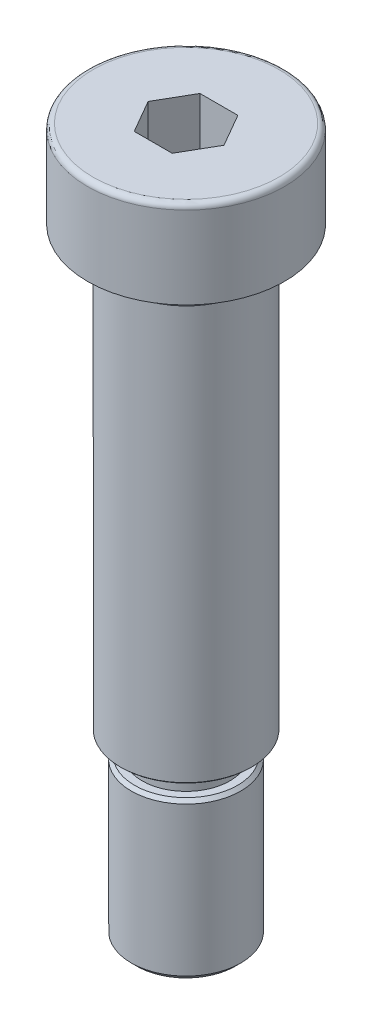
ISO-10303-21;
HEADER;
FILE_DESCRIPTION(('STEP AP214'),'2;1');
FILE_NAME('part.step','',(''),(''),'','','');
FILE_SCHEMA(('AUTOMOTIVE_DESIGN { 1 0 10303 214 1 1 1 1 }'));
ENDSEC;
DATA;
#1=APPLICATION_CONTEXT('core data for automotive mechanical design processes');
#2=APPLICATION_PROTOCOL_DEFINITION('international standard','automotive_design',2000,#1);
#3=PRODUCT_CONTEXT('',#1,'mechanical');
#4=PRODUCT('Part','Part','',(#3));
#5=PRODUCT_RELATED_PRODUCT_CATEGORY('part','',(#4));
#6=PRODUCT_DEFINITION_FORMATION('','',#4);
#7=PRODUCT_DEFINITION_CONTEXT('part definition',#1,'design');
#8=PRODUCT_DEFINITION('design','',#6,#7);
#9=PRODUCT_DEFINITION_SHAPE('','',#8);
#10=(LENGTH_UNIT() NAMED_UNIT(*) SI_UNIT(.MILLI.,.METRE.));
#11=(NAMED_UNIT(*) PLANE_ANGLE_UNIT() SI_UNIT($,.RADIAN.));
#12=(NAMED_UNIT(*) SI_UNIT($,.STERADIAN.) SOLID_ANGLE_UNIT());
#13=UNCERTAINTY_MEASURE_WITH_UNIT(LENGTH_MEASURE(1.E-05),#10,'distance_accuracy_value','');
#14=(GEOMETRIC_REPRESENTATION_CONTEXT(3) GLOBAL_UNCERTAINTY_ASSIGNED_CONTEXT((#13)) GLOBAL_UNIT_ASSIGNED_CONTEXT((#10,
#11,#12)) REPRESENTATION_CONTEXT('',''));
#15=CARTESIAN_POINT('',(0.,0.,0.));
#16=DIRECTION('',(0.,0.,1.));
#17=DIRECTION('',(1.,0.,0.));
#18=AXIS2_PLACEMENT_3D('',#15,#16,#17);
#19=CARTESIAN_POINT('',(-5.00000000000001,0.,0.));
#20=DIRECTION('',(0.,-1.,0.));
#21=DIRECTION('',(0.,0.,-1.));
#22=AXIS2_PLACEMENT_3D('',#19,#20,#21);
#23=PLANE('',#22);
#24=CARTESIAN_POINT('',(0.,0.,0.));
#25=DIRECTION('',(0.,-1.,0.));
#26=DIRECTION('',(0.,0.,-1.));
#27=AXIS2_PLACEMENT_3D('',#24,#25,#26);
#28=CIRCLE('',#27,4.5);
#29=CARTESIAN_POINT('',(0.,0.,-4.5));
#30=VERTEX_POINT('',#29);
#31=EDGE_CURVE('E177',#30,#30,#28,.T.);
#32=ORIENTED_EDGE('',*,*,#31,.T.);
#33=EDGE_LOOP('',(#32));
#34=FACE_BOUND('',#33,.T.);
#35=ADVANCED_FACE('F27',(#34),#23,.T.);
#36=CARTESIAN_POINT('',(0.,50.,0.));
#37=DIRECTION('',(0.,1.,0.));
#38=DIRECTION('',(0.,0.,1.));
#39=AXIS2_PLACEMENT_3D('',#36,#37,#38);
#40=CYLINDRICAL_SURFACE('',#39,5.00000000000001);
#41=CARTESIAN_POINT('',(0.,14.1,0.));
#42=DIRECTION('',(0.,1.,0.));
#43=DIRECTION('',(0.,0.,1.));
#44=AXIS2_PLACEMENT_3D('',#41,#42,#43);
#45=CIRCLE('',#44,5.00000000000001);
#46=CARTESIAN_POINT('',(0.,14.1,5.00000000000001));
#47=VERTEX_POINT('',#46);
#48=EDGE_CURVE('E11',#47,#47,#45,.F.);
#49=ORIENTED_EDGE('',*,*,#48,.T.);
#50=EDGE_LOOP('',(#49));
#51=FACE_BOUND('',#50,.T.);
#52=CARTESIAN_POINT('',(0.,0.500000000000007,0.));
#53=DIRECTION('',(0.,-1.,0.));
#54=DIRECTION('',(0.,0.,-1.));
#55=AXIS2_PLACEMENT_3D('',#52,#53,#54);
#56=CIRCLE('',#55,5.00000000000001);
#57=CARTESIAN_POINT('',(0.,0.500000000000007,-5.00000000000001));
#58=VERTEX_POINT('',#57);
#59=EDGE_CURVE('E174',#58,#58,#56,.F.);
#60=ORIENTED_EDGE('',*,*,#59,.T.);
#61=EDGE_LOOP('',(#60));
#62=FACE_BOUND('',#61,.T.);
#63=ADVANCED_FACE('F198',(#51,#62),#40,.T.);
#64=CARTESIAN_POINT('',(-4.,14.4,0.));
#65=DIRECTION('',(0.,1.,0.));
#66=DIRECTION('',(0.,0.,1.));
#67=AXIS2_PLACEMENT_3D('',#64,#65,#66);
#68=PLANE('',#67);
#69=CARTESIAN_POINT('',(0.,14.4,0.));
#70=DIRECTION('',(0.,1.,0.));
#71=DIRECTION('',(0.,0.,1.));
#72=AXIS2_PLACEMENT_3D('',#69,#70,#71);
#73=CIRCLE('',#72,4.7);
#74=CARTESIAN_POINT('',(0.,14.4,4.7));
#75=VERTEX_POINT('',#74);
#76=EDGE_CURVE('E34',#75,#75,#73,.T.);
#77=ORIENTED_EDGE('',*,*,#76,.T.);
#78=EDGE_LOOP('',(#77));
#79=FACE_BOUND('',#78,.T.);
#80=CARTESIAN_POINT('',(0.,14.4,0.));
#81=DIRECTION('',(0.,1.,0.));
#82=DIRECTION('',(0.,0.,1.));
#83=AXIS2_PLACEMENT_3D('',#80,#81,#82);
#84=CIRCLE('',#83,4.);
#85=CARTESIAN_POINT('',(0.,14.4,4.));
#86=VERTEX_POINT('',#85);
#87=EDGE_CURVE('E147',#86,#86,#84,.T.);
#88=ORIENTED_EDGE('',*,*,#87,.F.);
#89=EDGE_LOOP('',(#88));
#90=FACE_BOUND('',#89,.T.);
#91=ADVANCED_FACE('F182',(#79,#90),#68,.T.);
#92=CARTESIAN_POINT('',(0.,50.,0.));
#93=DIRECTION('',(0.,1.,0.));
#94=DIRECTION('',(0.,0.,1.));
#95=AXIS2_PLACEMENT_3D('',#92,#93,#94);
#96=CYLINDRICAL_SURFACE('',#95,4.);
#97=CARTESIAN_POINT('',(0.,16.2,0.));
#98=DIRECTION('',(0.,-1.,0.));
#99=DIRECTION('',(0.,0.,-1.));
#100=AXIS2_PLACEMENT_3D('',#97,#98,#99);
#101=CIRCLE('',#100,4.);
#102=CARTESIAN_POINT('',(0.,16.2,-4.));
#103=VERTEX_POINT('',#102);
#104=EDGE_CURVE('E171',#103,#103,#101,.T.);
#105=ORIENTED_EDGE('',*,*,#104,.T.);
#106=EDGE_LOOP('',(#105));
#107=FACE_BOUND('',#106,.T.);
#108=ORIENTED_EDGE('',*,*,#87,.T.);
#109=EDGE_LOOP('',(#108));
#110=FACE_BOUND('',#109,.T.);
#111=ADVANCED_FACE('F211',(#107,#110),#96,.T.);
#112=CARTESIAN_POINT('',(-6.,16.4,0.));
#113=DIRECTION('',(0.,-1.,0.));
#114=DIRECTION('',(0.,0.,-1.));
#115=AXIS2_PLACEMENT_3D('',#112,#113,#114);
#116=PLANE('',#115);
#117=CARTESIAN_POINT('',(0.,16.4,0.));
#118=DIRECTION('',(0.,-1.,0.));
#119=DIRECTION('',(0.,0.,-1.));
#120=AXIS2_PLACEMENT_3D('',#117,#118,#119);
#121=CIRCLE('',#120,4.2);
#122=CARTESIAN_POINT('',(0.,16.4,-4.2));
#123=VERTEX_POINT('',#122);
#124=EDGE_CURVE('E168',#123,#123,#121,.F.);
#125=ORIENTED_EDGE('',*,*,#124,.T.);
#126=EDGE_LOOP('',(#125));
#127=FACE_BOUND('',#126,.T.);
#128=CARTESIAN_POINT('',(0.,16.4,0.));
#129=DIRECTION('',(0.,-1.,0.));
#130=DIRECTION('',(0.,0.,-1.));
#131=AXIS2_PLACEMENT_3D('',#128,#129,#130);
#132=CIRCLE('',#131,5.9);
#133=CARTESIAN_POINT('',(0.,16.4,-5.9));
#134=VERTEX_POINT('',#133);
#135=EDGE_CURVE('E165',#134,#134,#132,.T.);
#136=ORIENTED_EDGE('',*,*,#135,.T.);
#137=EDGE_LOOP('',(#136));
#138=FACE_BOUND('',#137,.T.);
#139=ADVANCED_FACE('F216',(#127,#138),#116,.T.);
#140=CARTESIAN_POINT('',(0.,50.,0.));
#141=DIRECTION('',(0.,1.,0.));
#142=DIRECTION('',(0.,0.,1.));
#143=AXIS2_PLACEMENT_3D('',#140,#141,#142);
#144=CYLINDRICAL_SURFACE('',#143,6.);
#145=CARTESIAN_POINT('',(0.,16.5,0.));
#146=DIRECTION('',(0.,-1.,0.));
#147=DIRECTION('',(0.,0.,-1.));
#148=AXIS2_PLACEMENT_3D('',#145,#146,#147);
#149=CIRCLE('',#148,6.);
#150=CARTESIAN_POINT('',(0.,16.5,-6.));
#151=VERTEX_POINT('',#150);
#152=EDGE_CURVE('E162',#151,#151,#149,.F.);
#153=ORIENTED_EDGE('',*,*,#152,.T.);
#154=EDGE_LOOP('',(#153));
#155=FACE_BOUND('',#154,.T.);
#156=CARTESIAN_POINT('',(0.,54.2,0.));
#157=DIRECTION('',(0.,1.,0.));
#158=DIRECTION('',(0.,0.,1.));
#159=AXIS2_PLACEMENT_3D('',#156,#157,#158);
#160=CIRCLE('',#159,6.);
#161=CARTESIAN_POINT('',(0.,54.2,6.));
#162=VERTEX_POINT('',#161);
#163=EDGE_CURVE('E153',#162,#162,#160,.F.);
#164=ORIENTED_EDGE('',*,*,#163,.T.);
#165=EDGE_LOOP('',(#164));
#166=FACE_BOUND('',#165,.T.);
#167=ADVANCED_FACE('F220',(#155,#166),#144,.T.);
#168=CARTESIAN_POINT('',(-5.,54.4,0.));
#169=DIRECTION('',(0.,1.,0.));
#170=DIRECTION('',(0.,0.,1.));
#171=AXIS2_PLACEMENT_3D('',#168,#169,#170);
#172=PLANE('',#171);
#173=CARTESIAN_POINT('',(0.,54.4,0.));
#174=DIRECTION('',(0.,1.,0.));
#175=DIRECTION('',(0.,0.,1.));
#176=AXIS2_PLACEMENT_3D('',#173,#174,#175);
#177=CIRCLE('',#176,5.8);
#178=CARTESIAN_POINT('',(0.,54.4,5.8));
#179=VERTEX_POINT('',#178);
#180=EDGE_CURVE('E150',#179,#179,#177,.T.);
#181=ORIENTED_EDGE('',*,*,#180,.T.);
#182=EDGE_LOOP('',(#181));
#183=FACE_BOUND('',#182,.T.);
#184=CARTESIAN_POINT('',(0.,54.4,0.));
#185=DIRECTION('',(0.,1.,0.));
#186=DIRECTION('',(0.,0.,1.));
#187=AXIS2_PLACEMENT_3D('',#184,#185,#186);
#188=CIRCLE('',#187,5.);
#189=CARTESIAN_POINT('',(0.,54.4,5.));
#190=VERTEX_POINT('',#189);
#191=EDGE_CURVE('E144',#190,#190,#188,.T.);
#192=ORIENTED_EDGE('',*,*,#191,.F.);
#193=EDGE_LOOP('',(#192));
#194=FACE_BOUND('',#193,.T.);
#195=ADVANCED_FACE('F224',(#183,#194),#172,.T.);
#196=CARTESIAN_POINT('',(0.,50.,0.));
#197=DIRECTION('',(0.,1.,0.));
#198=DIRECTION('',(0.,0.,1.));
#199=AXIS2_PLACEMENT_3D('',#196,#197,#198);
#200=CYLINDRICAL_SURFACE('',#199,5.);
#201=CARTESIAN_POINT('',(0.,56.3,0.));
#202=DIRECTION('',(0.,-1.,0.));
#203=DIRECTION('',(0.,0.,-1.));
#204=AXIS2_PLACEMENT_3D('',#201,#202,#203);
#205=CIRCLE('',#204,5.);
#206=CARTESIAN_POINT('',(0.,56.3,-5.));
#207=VERTEX_POINT('',#206);
#208=EDGE_CURVE('E159',#207,#207,#205,.T.);
#209=ORIENTED_EDGE('',*,*,#208,.T.);
#210=EDGE_LOOP('',(#209));
#211=FACE_BOUND('',#210,.T.);
#212=ORIENTED_EDGE('',*,*,#191,.T.);
#213=EDGE_LOOP('',(#212));
#214=FACE_BOUND('',#213,.T.);
#215=ADVANCED_FACE('F228',(#211,#214),#200,.T.);
#216=CARTESIAN_POINT('',(-9.,56.4,0.));
#217=DIRECTION('',(0.,-1.,0.));
#218=DIRECTION('',(0.,0.,-1.));
#219=AXIS2_PLACEMENT_3D('',#216,#217,#218);
#220=PLANE('',#219);
#221=CARTESIAN_POINT('',(0.,56.4,0.));
#222=DIRECTION('',(0.,-1.,0.));
#223=DIRECTION('',(0.,0.,-1.));
#224=AXIS2_PLACEMENT_3D('',#221,#222,#223);
#225=CIRCLE('',#224,5.1);
#226=CARTESIAN_POINT('',(0.,56.4,-5.1));
#227=VERTEX_POINT('',#226);
#228=EDGE_CURVE('E156',#227,#227,#225,.F.);
#229=ORIENTED_EDGE('',*,*,#228,.T.);
#230=EDGE_LOOP('',(#229));
#231=FACE_BOUND('',#230,.T.);
#232=CARTESIAN_POINT('',(0.,56.4,0.));
#233=DIRECTION('',(0.,1.,0.));
#234=DIRECTION('',(0.,0.,1.));
#235=AXIS2_PLACEMENT_3D('',#232,#233,#234);
#236=CIRCLE('',#235,9.);
#237=CARTESIAN_POINT('',(0.,56.4,9.));
#238=VERTEX_POINT('',#237);
#239=EDGE_CURVE('E141',#238,#238,#236,.T.);
#240=ORIENTED_EDGE('',*,*,#239,.F.);
#241=EDGE_LOOP('',(#240));
#242=FACE_BOUND('',#241,.T.);
#243=ADVANCED_FACE('F232',(#231,#242),#220,.T.);
#244=CARTESIAN_POINT('',(0.,50.,0.));
#245=DIRECTION('',(0.,1.,0.));
#246=DIRECTION('',(0.,0.,1.));
#247=AXIS2_PLACEMENT_3D('',#244,#245,#246);
#248=CYLINDRICAL_SURFACE('',#247,9.);
#249=ORIENTED_EDGE('',*,*,#239,.T.);
#250=EDGE_LOOP('',(#249));
#251=FACE_BOUND('',#250,.T.);
#252=CARTESIAN_POINT('',(0.,63.9,0.));
#253=DIRECTION('',(0.,1.,0.));
#254=DIRECTION('',(0.,0.,1.));
#255=AXIS2_PLACEMENT_3D('',#252,#253,#254);
#256=CIRCLE('',#255,9.);
#257=CARTESIAN_POINT('',(0.,63.9,9.));
#258=VERTEX_POINT('',#257);
#259=EDGE_CURVE('E138',#258,#258,#256,.T.);
#260=ORIENTED_EDGE('',*,*,#259,.F.);
#261=EDGE_LOOP('',(#260));
#262=FACE_BOUND('',#261,.T.);
#263=ADVANCED_FACE('F236',(#251,#262),#248,.T.);
#264=CARTESIAN_POINT('',(0.,63.9,0.));
#265=DIRECTION('',(0.,1.,0.));
#266=DIRECTION('',(0.,0.,1.));
#267=AXIS2_PLACEMENT_3D('',#264,#265,#266);
#268=TOROIDAL_SURFACE('',#267,8.5,0.5);
#269=CARTESIAN_POINT('',(0.,64.4,0.));
#270=DIRECTION('',(0.,1.,0.));
#271=DIRECTION('',(0.,0.,1.));
#272=AXIS2_PLACEMENT_3D('',#269,#270,#271);
#273=CIRCLE('',#272,8.5);
#274=CARTESIAN_POINT('',(0.,64.4,8.5));
#275=VERTEX_POINT('',#274);
#276=EDGE_CURVE('E129',#275,#275,#273,.T.);
#277=ORIENTED_EDGE('',*,*,#276,.F.);
#278=EDGE_LOOP('',(#277));
#279=FACE_BOUND('',#278,.T.);
#280=ORIENTED_EDGE('',*,*,#259,.T.);
#281=EDGE_LOOP('',(#280));
#282=FACE_BOUND('',#281,.T.);
#283=ADVANCED_FACE('F240',(#279,#282),#268,.T.);
#284=CARTESIAN_POINT('',(0.,64.4,0.));
#285=DIRECTION('',(0.,1.,0.));
#286=DIRECTION('',(0.,0.,1.));
#287=AXIS2_PLACEMENT_3D('',#284,#285,#286);
#288=PLANE('',#287);
#289=DIRECTION('',(-0.5,0.,0.866025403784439));
#290=VECTOR('',#289,1.);
#291=CARTESIAN_POINT('',(-1.73205080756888,64.4,-3.));
#292=LINE('',#291,#290);
#293=CARTESIAN_POINT('',(-1.73205080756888,64.4,-3.));
#294=VERTEX_POINT('',#293);
#295=CARTESIAN_POINT('',(-3.46410161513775,64.4,0.));
#296=VERTEX_POINT('',#295);
#297=EDGE_CURVE('E41',#294,#296,#292,.T.);
#298=ORIENTED_EDGE('',*,*,#297,.F.);
#299=DIRECTION('',(-1.,0.,0.));
#300=VECTOR('',#299,1.);
#301=CARTESIAN_POINT('',(1.73205080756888,64.4,-3.));
#302=LINE('',#301,#300);
#303=CARTESIAN_POINT('',(1.73205080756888,64.4,-3.));
#304=VERTEX_POINT('',#303);
#305=EDGE_CURVE('E111',#304,#294,#302,.T.);
#306=ORIENTED_EDGE('',*,*,#305,.F.);
#307=DIRECTION('',(-0.5,0.,-0.866025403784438));
#308=VECTOR('',#307,1.);
#309=CARTESIAN_POINT('',(3.46410161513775,64.4,0.));
#310=LINE('',#309,#308);
#311=CARTESIAN_POINT('',(3.46410161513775,64.4,0.));
#312=VERTEX_POINT('',#311);
#313=EDGE_CURVE('E105',#312,#304,#310,.T.);
#314=ORIENTED_EDGE('',*,*,#313,.F.);
#315=DIRECTION('',(0.5,0.,-0.866025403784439));
#316=VECTOR('',#315,1.);
#317=CARTESIAN_POINT('',(1.73205080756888,64.4,3.));
#318=LINE('',#317,#316);
#319=CARTESIAN_POINT('',(1.73205080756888,64.4,3.));
#320=VERTEX_POINT('',#319);
#321=EDGE_CURVE('E103',#320,#312,#318,.T.);
#322=ORIENTED_EDGE('',*,*,#321,.F.);
#323=DIRECTION('',(1.,0.,0.));
#324=VECTOR('',#323,1.);
#325=CARTESIAN_POINT('',(-1.73205080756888,64.4,3.));
#326=LINE('',#325,#324);
#327=CARTESIAN_POINT('',(-1.73205080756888,64.4,3.));
#328=VERTEX_POINT('',#327);
#329=EDGE_CURVE('E84',#328,#320,#326,.T.);
#330=ORIENTED_EDGE('',*,*,#329,.F.);
#331=DIRECTION('',(0.5,0.,0.866025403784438));
#332=VECTOR('',#331,1.);
#333=CARTESIAN_POINT('',(-3.46410161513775,64.4,0.));
#334=LINE('',#333,#332);
#335=EDGE_CURVE('E95',#296,#328,#334,.T.);
#336=ORIENTED_EDGE('',*,*,#335,.F.);
#337=EDGE_LOOP('',(#298,#306,#314,#322,#330,#336));
#338=FACE_BOUND('',#337,.T.);
#339=ORIENTED_EDGE('',*,*,#276,.T.);
#340=EDGE_LOOP('',(#339));
#341=FACE_BOUND('',#340,.T.);
#342=ADVANCED_FACE('F99',(#338,#341),#288,.T.);
#343=CARTESIAN_POINT('',(-1.73205080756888,59.4,-3.));
#344=DIRECTION('',(-0.866025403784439,0.,-0.5));
#345=DIRECTION('',(-0.5,0.,0.866025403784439));
#346=AXIS2_PLACEMENT_3D('',#343,#344,#345);
#347=PLANE('',#346);
#348=ORIENTED_EDGE('',*,*,#297,.T.);
#349=DIRECTION('',(0.,1.,0.));
#350=VECTOR('',#349,1.);
#351=CARTESIAN_POINT('',(-3.46410161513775,59.4,0.));
#352=LINE('',#351,#350);
#353=CARTESIAN_POINT('',(-3.46410161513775,59.4,0.));
#354=VERTEX_POINT('',#353);
#355=EDGE_CURVE('E92',#354,#296,#352,.T.);
#356=ORIENTED_EDGE('',*,*,#355,.F.);
#357=DIRECTION('',(-0.5,0.,0.866025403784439));
#358=VECTOR('',#357,1.);
#359=CARTESIAN_POINT('',(-1.73205080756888,59.4,-3.));
#360=LINE('',#359,#358);
#361=CARTESIAN_POINT('',(-1.73205080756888,59.4,-3.));
#362=VERTEX_POINT('',#361);
#363=EDGE_CURVE('E113',#362,#354,#360,.T.);
#364=ORIENTED_EDGE('',*,*,#363,.F.);
#365=DIRECTION('',(0.,1.,0.));
#366=VECTOR('',#365,1.);
#367=CARTESIAN_POINT('',(-1.73205080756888,59.4,-3.));
#368=LINE('',#367,#366);
#369=EDGE_CURVE('E48',#362,#294,#368,.T.);
#370=ORIENTED_EDGE('',*,*,#369,.T.);
#371=EDGE_LOOP('',(#348,#356,#364,#370));
#372=FACE_BOUND('',#371,.T.);
#373=ADVANCED_FACE('F247',(#372),#347,.F.);
#374=CARTESIAN_POINT('',(1.73205080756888,59.4,-3.));
#375=DIRECTION('',(0.,0.,-1.));
#376=DIRECTION('',(-1.,0.,0.));
#377=AXIS2_PLACEMENT_3D('',#374,#375,#376);
#378=PLANE('',#377);
#379=ORIENTED_EDGE('',*,*,#305,.T.);
#380=ORIENTED_EDGE('',*,*,#369,.F.);
#381=DIRECTION('',(-1.,0.,0.));
#382=VECTOR('',#381,1.);
#383=CARTESIAN_POINT('',(1.73205080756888,59.4,-3.));
#384=LINE('',#383,#382);
#385=CARTESIAN_POINT('',(1.73205080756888,59.4,-3.));
#386=VERTEX_POINT('',#385);
#387=EDGE_CURVE('E125',#386,#362,#384,.T.);
#388=ORIENTED_EDGE('',*,*,#387,.F.);
#389=DIRECTION('',(0.,1.,0.));
#390=VECTOR('',#389,1.);
#391=CARTESIAN_POINT('',(1.73205080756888,59.4,-3.));
#392=LINE('',#391,#390);
#393=EDGE_CURVE('E130',#386,#304,#392,.T.);
#394=ORIENTED_EDGE('',*,*,#393,.T.);
#395=EDGE_LOOP('',(#379,#380,#388,#394));
#396=FACE_BOUND('',#395,.T.);
#397=ADVANCED_FACE('F250',(#396),#378,.F.);
#398=CARTESIAN_POINT('',(3.46410161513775,59.4,0.));
#399=DIRECTION('',(0.866025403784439,0.,-0.5));
#400=DIRECTION('',(-0.5,0.,-0.866025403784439));
#401=AXIS2_PLACEMENT_3D('',#398,#399,#400);
#402=PLANE('',#401);
#403=ORIENTED_EDGE('',*,*,#313,.T.);
#404=ORIENTED_EDGE('',*,*,#393,.F.);
#405=DIRECTION('',(-0.5,0.,-0.866025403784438));
#406=VECTOR('',#405,1.);
#407=CARTESIAN_POINT('',(3.46410161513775,59.4,0.));
#408=LINE('',#407,#406);
#409=CARTESIAN_POINT('',(3.46410161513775,59.4,0.));
#410=VERTEX_POINT('',#409);
#411=EDGE_CURVE('E122',#410,#386,#408,.T.);
#412=ORIENTED_EDGE('',*,*,#411,.F.);
#413=DIRECTION('',(0.,1.,0.));
#414=VECTOR('',#413,1.);
#415=CARTESIAN_POINT('',(3.46410161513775,59.4,0.));
#416=LINE('',#415,#414);
#417=EDGE_CURVE('E132',#410,#312,#416,.T.);
#418=ORIENTED_EDGE('',*,*,#417,.T.);
#419=EDGE_LOOP('',(#403,#404,#412,#418));
#420=FACE_BOUND('',#419,.T.);
#421=ADVANCED_FACE('F259',(#420),#402,.F.);
#422=CARTESIAN_POINT('',(1.73205080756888,59.4,3.));
#423=DIRECTION('',(0.866025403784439,0.,0.5));
#424=DIRECTION('',(0.5,0.,-0.866025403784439));
#425=AXIS2_PLACEMENT_3D('',#422,#423,#424);
#426=PLANE('',#425);
#427=ORIENTED_EDGE('',*,*,#321,.T.);
#428=ORIENTED_EDGE('',*,*,#417,.F.);
#429=DIRECTION('',(0.5,0.,-0.866025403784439));
#430=VECTOR('',#429,1.);
#431=CARTESIAN_POINT('',(1.73205080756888,59.4,3.));
#432=LINE('',#431,#430);
#433=CARTESIAN_POINT('',(1.73205080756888,59.4,3.));
#434=VERTEX_POINT('',#433);
#435=EDGE_CURVE('E119',#434,#410,#432,.T.);
#436=ORIENTED_EDGE('',*,*,#435,.F.);
#437=DIRECTION('',(0.,1.,0.));
#438=VECTOR('',#437,1.);
#439=CARTESIAN_POINT('',(1.73205080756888,59.4,3.));
#440=LINE('',#439,#438);
#441=EDGE_CURVE('E91',#434,#320,#440,.T.);
#442=ORIENTED_EDGE('',*,*,#441,.T.);
#443=EDGE_LOOP('',(#427,#428,#436,#442));
#444=FACE_BOUND('',#443,.T.);
#445=ADVANCED_FACE('F256',(#444),#426,.F.);
#446=CARTESIAN_POINT('',(-1.73205080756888,59.4,3.));
#447=DIRECTION('',(0.,0.,1.));
#448=DIRECTION('',(1.,0.,0.));
#449=AXIS2_PLACEMENT_3D('',#446,#447,#448);
#450=PLANE('',#449);
#451=ORIENTED_EDGE('',*,*,#329,.T.);
#452=ORIENTED_EDGE('',*,*,#441,.F.);
#453=DIRECTION('',(1.,0.,0.));
#454=VECTOR('',#453,1.);
#455=CARTESIAN_POINT('',(-1.73205080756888,59.4,3.));
#456=LINE('',#455,#454);
#457=CARTESIAN_POINT('',(-1.73205080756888,59.4,3.));
#458=VERTEX_POINT('',#457);
#459=EDGE_CURVE('E87',#458,#434,#456,.T.);
#460=ORIENTED_EDGE('',*,*,#459,.F.);
#461=DIRECTION('',(0.,1.,0.));
#462=VECTOR('',#461,1.);
#463=CARTESIAN_POINT('',(-1.73205080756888,59.4,3.));
#464=LINE('',#463,#462);
#465=EDGE_CURVE('E80',#458,#328,#464,.T.);
#466=ORIENTED_EDGE('',*,*,#465,.T.);
#467=EDGE_LOOP('',(#451,#452,#460,#466));
#468=FACE_BOUND('',#467,.T.);
#469=ADVANCED_FACE('F82',(#468),#450,.F.);
#470=CARTESIAN_POINT('',(-3.46410161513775,59.4,0.));
#471=DIRECTION('',(-0.866025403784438,0.,0.5));
#472=DIRECTION('',(0.5,0.,0.866025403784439));
#473=AXIS2_PLACEMENT_3D('',#470,#471,#472);
#474=PLANE('',#473);
#475=ORIENTED_EDGE('',*,*,#335,.T.);
#476=ORIENTED_EDGE('',*,*,#465,.F.);
#477=DIRECTION('',(0.5,0.,0.866025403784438));
#478=VECTOR('',#477,1.);
#479=CARTESIAN_POINT('',(-3.46410161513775,59.4,0.));
#480=LINE('',#479,#478);
#481=EDGE_CURVE('E116',#354,#458,#480,.T.);
#482=ORIENTED_EDGE('',*,*,#481,.F.);
#483=ORIENTED_EDGE('',*,*,#355,.T.);
#484=EDGE_LOOP('',(#475,#476,#482,#483));
#485=FACE_BOUND('',#484,.T.);
#486=ADVANCED_FACE('F96',(#485),#474,.F.);
#487=CARTESIAN_POINT('',(-1.73205080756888,59.4,-3.));
#488=DIRECTION('',(0.,-1.,0.));
#489=DIRECTION('',(0.,0.,-1.));
#490=AXIS2_PLACEMENT_3D('',#487,#488,#489);
#491=PLANE('',#490);
#492=ORIENTED_EDGE('',*,*,#363,.T.);
#493=ORIENTED_EDGE('',*,*,#481,.T.);
#494=ORIENTED_EDGE('',*,*,#459,.T.);
#495=ORIENTED_EDGE('',*,*,#435,.T.);
#496=ORIENTED_EDGE('',*,*,#411,.T.);
#497=ORIENTED_EDGE('',*,*,#387,.T.);
#498=EDGE_LOOP('',(#492,#493,#494,#495,#496,#497));
#499=FACE_BOUND('',#498,.T.);
#500=ADVANCED_FACE('F253',(#499),#491,.F.);
#501=CARTESIAN_POINT('',(0.,54.4,0.));
#502=DIRECTION('',(0.,-1.,0.));
#503=DIRECTION('',(0.,0.,-1.));
#504=AXIS2_PLACEMENT_3D('',#501,#502,#503);
#505=CONICAL_SURFACE('',#504,5.8,0.785398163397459);
#506=ORIENTED_EDGE('',*,*,#163,.F.);
#507=EDGE_LOOP('',(#506));
#508=FACE_BOUND('',#507,.T.);
#509=ORIENTED_EDGE('',*,*,#180,.F.);
#510=EDGE_LOOP('',(#509));
#511=FACE_BOUND('',#510,.T.);
#512=ADVANCED_FACE('F268',(#508,#511),#505,.T.);
#513=CARTESIAN_POINT('',(0.,56.3,0.));
#514=DIRECTION('',(0.,-1.,0.));
#515=DIRECTION('',(0.,0.,-1.));
#516=AXIS2_PLACEMENT_3D('',#513,#514,#515);
#517=TOROIDAL_SURFACE('',#516,5.1,0.1);
#518=ORIENTED_EDGE('',*,*,#208,.F.);
#519=EDGE_LOOP('',(#518));
#520=FACE_BOUND('',#519,.T.);
#521=ORIENTED_EDGE('',*,*,#228,.F.);
#522=EDGE_LOOP('',(#521));
#523=FACE_BOUND('',#522,.T.);
#524=ADVANCED_FACE('F272',(#520,#523),#517,.F.);
#525=CARTESIAN_POINT('',(0.,16.5,0.));
#526=DIRECTION('',(0.,1.,0.));
#527=DIRECTION('',(0.,0.,1.));
#528=AXIS2_PLACEMENT_3D('',#525,#526,#527);
#529=CONICAL_SURFACE('',#528,6.,0.78539816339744);
#530=ORIENTED_EDGE('',*,*,#135,.F.);
#531=EDGE_LOOP('',(#530));
#532=FACE_BOUND('',#531,.T.);
#533=ORIENTED_EDGE('',*,*,#152,.F.);
#534=EDGE_LOOP('',(#533));
#535=FACE_BOUND('',#534,.T.);
#536=ADVANCED_FACE('F276',(#532,#535),#529,.T.);
#537=CARTESIAN_POINT('',(0.,16.2,0.));
#538=DIRECTION('',(0.,-1.,0.));
#539=DIRECTION('',(0.,0.,-1.));
#540=AXIS2_PLACEMENT_3D('',#537,#538,#539);
#541=TOROIDAL_SURFACE('',#540,4.2,0.2);
#542=ORIENTED_EDGE('',*,*,#104,.F.);
#543=EDGE_LOOP('',(#542));
#544=FACE_BOUND('',#543,.T.);
#545=ORIENTED_EDGE('',*,*,#124,.F.);
#546=EDGE_LOOP('',(#545));
#547=FACE_BOUND('',#546,.T.);
#548=ADVANCED_FACE('F193',(#544,#547),#541,.F.);
#549=CARTESIAN_POINT('',(0.,0.500000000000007,0.));
#550=DIRECTION('',(0.,1.,0.));
#551=DIRECTION('',(0.,0.,1.));
#552=AXIS2_PLACEMENT_3D('',#549,#550,#551);
#553=CONICAL_SURFACE('',#552,5.00000000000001,0.785398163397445);
#554=ORIENTED_EDGE('',*,*,#31,.F.);
#555=EDGE_LOOP('',(#554));
#556=FACE_BOUND('',#555,.T.);
#557=ORIENTED_EDGE('',*,*,#59,.F.);
#558=EDGE_LOOP('',(#557));
#559=FACE_BOUND('',#558,.T.);
#560=ADVANCED_FACE('F187',(#556,#559),#553,.T.);
#561=CARTESIAN_POINT('',(0.,14.4,0.));
#562=DIRECTION('',(0.,-1.,0.));
#563=DIRECTION('',(0.,0.,-1.));
#564=AXIS2_PLACEMENT_3D('',#561,#562,#563);
#565=CONICAL_SURFACE('',#564,4.7,0.785398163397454);
#566=ORIENTED_EDGE('',*,*,#48,.F.);
#567=EDGE_LOOP('',(#566));
#568=FACE_BOUND('',#567,.T.);
#569=ORIENTED_EDGE('',*,*,#76,.F.);
#570=EDGE_LOOP('',(#569));
#571=FACE_BOUND('',#570,.T.);
#572=ADVANCED_FACE('F185',(#568,#571),#565,.T.);
#573=CLOSED_SHELL('',(#35,#63,#91,#111,#139,#167,#195,#215,#243,#263,#283,#342,#373,#397,#421,
#445,#469,#486,#500,#512,#524,#536,#548,#560,#572));
#574=MANIFOLD_SOLID_BREP('B2',#573);
#575=ADVANCED_BREP_SHAPE_REPRESENTATION('',(#18,#574),#14);
#576=SHAPE_DEFINITION_REPRESENTATION(#9,#575);
ENDSEC;
END-ISO-10303-21;
